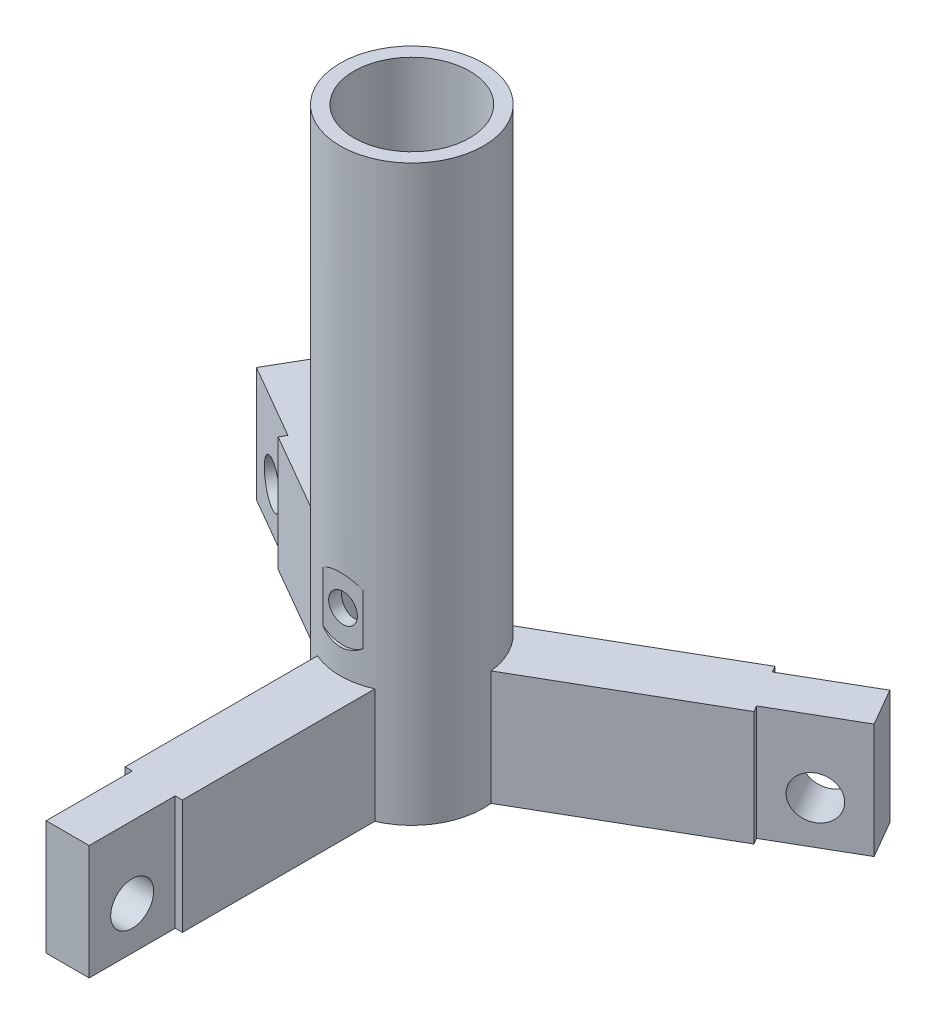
from build123d import *

# Parameters (mm, degrees)
SKETCH1_R           = 15.875
SKETCH1_R_2         = 12.827
BASE_EXTRUDE_DEPTH  = 127
BOSS_EXTRUDE1_START = -61.056215
SKETCH2_W           = 9.525
SKETCH2_H           = 25.4
BOSS_EXTRUDE1_DEPTH = 61.056215
SKETCH3_R           = 4.7625
CUT_EXTRUDE1_DEPTH  = 150.537107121
BOSS_EXTRUDE2_START = -42.600322
SKETCH13_W          = 12.7
SKETCH13_H          = 25.4
BOSS_EXTRUDE2_DEPTH = 42.600322
CIRPATTERN1_COUNT   = 3
SKETCH10_R          = 7.1501
CUT_EXTRUDE2_DEPTH  = 0.635


with BuildPart() as part:
    # Sketch1 → Base-Extrude (new body)
    with BuildSketch(Plane(origin=(0, 0, 0), x_dir=(1, 0, 0), z_dir=(0, 1, 0))):
        with Locations(Location((0, 0, 0), (0, 0, 270))):
            Circle(SKETCH1_R)
        with Locations(Location((0, 0, 0), (0, 0, 270))):
            Circle(SKETCH1_R_2, mode=Mode.SUBTRACT)
    extrude(amount=BASE_EXTRUDE_DEPTH)

    # Sketch2 → Boss-Extrude1 (add)
    with BuildSketch(Plane(origin=(0, 0, 76.2), x_dir=(-1, 0, 0), z_dir=(0, 0, 1)).offset(BOSS_EXTRUDE1_START)):
        with Locations((0, -12.7)):
            Rectangle(SKETCH2_W, SKETCH2_H)
    boss_extrude1 = extrude(amount=BOSS_EXTRUDE1_DEPTH)

    # Sketch3 → Cut-Extrude1 (cut, through all)
    with BuildSketch(Plane(origin=(4.7625, 0, 0), x_dir=(0, 0, -1), z_dir=(1, 0, 0))):
        with Locations(Location((-66.675, 9.525, 0), (0, 0, 90))):
            Circle(SKETCH3_R)
    cut_extrude1 = extrude(amount=-CUT_EXTRUDE1_DEPTH, mode=Mode.SUBTRACT)

    # Sketch13 → Boss-Extrude2 (add)
    with BuildSketch(Plane(origin=(0, 0, 57.15), x_dir=(-1, 0, 0), z_dir=(0, 0, 1)).offset(BOSS_EXTRUDE2_START)):
        with Locations((0, -12.7)):
            Rectangle(SKETCH13_W, SKETCH13_H)
    boss_extrude2 = extrude(amount=BOSS_EXTRUDE2_DEPTH)

    # CirPattern1: Boss-Extrude1, Cut-Extrude1, Boss-Extrude2 ×3 about axis
    cirpattern1_axis = Axis((0, 0, 0), (0, 1, 0))
    add([boss_extrude1.rotate(cirpattern1_axis, i * 360 / CIRPATTERN1_COUNT) for i in range(1, CIRPATTERN1_COUNT)])
    add([cut_extrude1.rotate(cirpattern1_axis, i * 360 / CIRPATTERN1_COUNT) for i in range(1, CIRPATTERN1_COUNT)], mode=Mode.SUBTRACT)
    add([boss_extrude2.rotate(cirpattern1_axis, i * 360 / CIRPATTERN1_COUNT) for i in range(1, CIRPATTERN1_COUNT)])

    # Sketch10 → Cut-Extrude2 (cut)
    with BuildSketch(Plane(origin=(0, 0, 15.875), x_dir=(-1, 0, 0), z_dir=(0, 0, 1))):
        with Locations((0, -38.1)):
            Circle(SKETCH10_R)
    extrude(amount=-CUT_EXTRUDE2_DEPTH, mode=Mode.SUBTRACT)

    # Sketch12 → Hole1 (revolve, cut)
    with BuildSketch(Plane(origin=(0, 38.1, 15.24), x_dir=(0, -1, 0), z_dir=(1, 0, 0))):
        Polygon((0, 0), (0, 14.233804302), (2.552697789, 12.699989), (2.552697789, 9.52499175), (3.17499725, 9.52499175), (3.17499725, 0.002539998), (3.17499725, 0), align=None)
    revolve(axis=Axis((0, 38.1, 15.24), (0, 0, -1)), mode=Mode.SUBTRACT)


solid = part.part
